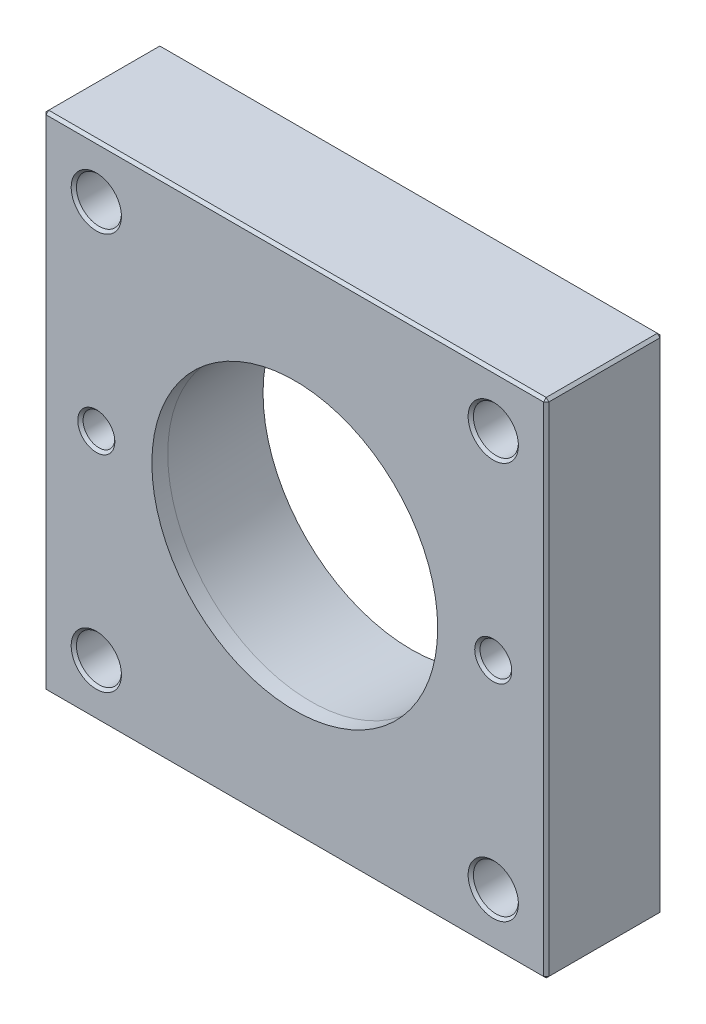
ISO-10303-21;
HEADER;
FILE_DESCRIPTION(('STEP AP214'),'2;1');
FILE_NAME('part.step','',(''),(''),'','','');
FILE_SCHEMA(('AUTOMOTIVE_DESIGN { 1 0 10303 214 1 1 1 1 }'));
ENDSEC;
DATA;
#1=APPLICATION_CONTEXT('core data for automotive mechanical design processes');
#2=APPLICATION_PROTOCOL_DEFINITION('international standard','automotive_design',2000,#1);
#3=PRODUCT_CONTEXT('',#1,'mechanical');
#4=PRODUCT('Part','Part','',(#3));
#5=PRODUCT_RELATED_PRODUCT_CATEGORY('part','',(#4));
#6=PRODUCT_DEFINITION_FORMATION('','',#4);
#7=PRODUCT_DEFINITION_CONTEXT('part definition',#1,'design');
#8=PRODUCT_DEFINITION('design','',#6,#7);
#9=PRODUCT_DEFINITION_SHAPE('','',#8);
#10=(LENGTH_UNIT() NAMED_UNIT(*) SI_UNIT(.MILLI.,.METRE.));
#11=(NAMED_UNIT(*) PLANE_ANGLE_UNIT() SI_UNIT($,.RADIAN.));
#12=(NAMED_UNIT(*) SI_UNIT($,.STERADIAN.) SOLID_ANGLE_UNIT());
#13=UNCERTAINTY_MEASURE_WITH_UNIT(LENGTH_MEASURE(1.E-05),#10,'distance_accuracy_value','');
#14=(GEOMETRIC_REPRESENTATION_CONTEXT(3) GLOBAL_UNCERTAINTY_ASSIGNED_CONTEXT((#13)) GLOBAL_UNIT_ASSIGNED_CONTEXT((#10,
#11,#12)) REPRESENTATION_CONTEXT('',''));
#15=CARTESIAN_POINT('',(0.,0.,0.));
#16=DIRECTION('',(0.,0.,1.));
#17=DIRECTION('',(1.,0.,0.));
#18=AXIS2_PLACEMENT_3D('',#15,#16,#17);
#19=CARTESIAN_POINT('',(-47.5,-47.5,-22.));
#20=DIRECTION('',(0.,0.,-1.));
#21=DIRECTION('',(-1.,0.,0.));
#22=AXIS2_PLACEMENT_3D('',#19,#20,#21);
#23=PLANE('',#22);
#24=DIRECTION('',(0.,1.,0.));
#25=VECTOR('',#24,1.);
#26=CARTESIAN_POINT('',(-47.,47.5,-22.));
#27=LINE('',#26,#25);
#28=CARTESIAN_POINT('',(-47.,-47.,-22.));
#29=VERTEX_POINT('',#28);
#30=CARTESIAN_POINT('',(-47.,47.,-22.));
#31=VERTEX_POINT('',#30);
#32=EDGE_CURVE('E175',#29,#31,#27,.T.);
#33=ORIENTED_EDGE('',*,*,#32,.T.);
#34=DIRECTION('',(1.,0.,0.));
#35=VECTOR('',#34,1.);
#36=CARTESIAN_POINT('',(-47.5,47.,-22.));
#37=LINE('',#36,#35);
#38=CARTESIAN_POINT('',(47.,47.,-22.));
#39=VERTEX_POINT('',#38);
#40=EDGE_CURVE('E140',#31,#39,#37,.T.);
#41=ORIENTED_EDGE('',*,*,#40,.T.);
#42=DIRECTION('',(0.,-1.,0.));
#43=VECTOR('',#42,1.);
#44=CARTESIAN_POINT('',(47.,-47.5,-22.));
#45=LINE('',#44,#43);
#46=CARTESIAN_POINT('',(47.,-47.,-22.));
#47=VERTEX_POINT('',#46);
#48=EDGE_CURVE('E177',#39,#47,#45,.T.);
#49=ORIENTED_EDGE('',*,*,#48,.T.);
#50=DIRECTION('',(-1.,0.,0.));
#51=VECTOR('',#50,1.);
#52=CARTESIAN_POINT('',(-47.5,-47.,-22.));
#53=LINE('',#52,#51);
#54=EDGE_CURVE('E170',#47,#29,#53,.T.);
#55=ORIENTED_EDGE('',*,*,#54,.T.);
#56=EDGE_LOOP('',(#33,#41,#49,#55));
#57=FACE_BOUND('',#56,.T.);
#58=CARTESIAN_POINT('',(37.5,37.5,-22.));
#59=DIRECTION('',(0.,0.,-1.));
#60=DIRECTION('',(-1.,0.,0.));
#61=AXIS2_PLACEMENT_3D('',#58,#59,#60);
#62=CIRCLE('',#61,4.75000000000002);
#63=CARTESIAN_POINT('',(32.75,37.5,-22.));
#64=VERTEX_POINT('',#63);
#65=EDGE_CURVE('E334',#64,#64,#62,.F.);
#66=ORIENTED_EDGE('',*,*,#65,.T.);
#67=EDGE_LOOP('',(#66));
#68=FACE_BOUND('',#67,.T.);
#69=CARTESIAN_POINT('',(-37.5,37.5,-22.));
#70=DIRECTION('',(0.,0.,-1.));
#71=DIRECTION('',(-1.,0.,0.));
#72=AXIS2_PLACEMENT_3D('',#69,#70,#71);
#73=CIRCLE('',#72,4.75000000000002);
#74=CARTESIAN_POINT('',(-42.25,37.5,-22.));
#75=VERTEX_POINT('',#74);
#76=EDGE_CURVE('E331',#75,#75,#73,.F.);
#77=ORIENTED_EDGE('',*,*,#76,.T.);
#78=EDGE_LOOP('',(#77));
#79=FACE_BOUND('',#78,.T.);
#80=CARTESIAN_POINT('',(-37.5,0.,-22.));
#81=DIRECTION('',(0.,0.,-1.));
#82=DIRECTION('',(-1.,0.,0.));
#83=AXIS2_PLACEMENT_3D('',#80,#81,#82);
#84=CIRCLE('',#83,3.50000000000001);
#85=CARTESIAN_POINT('',(-41.,0.,-22.));
#86=VERTEX_POINT('',#85);
#87=EDGE_CURVE('E328',#86,#86,#84,.F.);
#88=ORIENTED_EDGE('',*,*,#87,.T.);
#89=EDGE_LOOP('',(#88));
#90=FACE_BOUND('',#89,.T.);
#91=CARTESIAN_POINT('',(37.5,0.,-22.));
#92=DIRECTION('',(0.,0.,-1.));
#93=DIRECTION('',(-1.,0.,0.));
#94=AXIS2_PLACEMENT_3D('',#91,#92,#93);
#95=CIRCLE('',#94,3.50000000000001);
#96=CARTESIAN_POINT('',(34.,0.,-22.));
#97=VERTEX_POINT('',#96);
#98=EDGE_CURVE('E325',#97,#97,#95,.F.);
#99=ORIENTED_EDGE('',*,*,#98,.T.);
#100=EDGE_LOOP('',(#99));
#101=FACE_BOUND('',#100,.T.);
#102=CARTESIAN_POINT('',(37.5,-37.5,-22.));
#103=DIRECTION('',(0.,0.,-1.));
#104=DIRECTION('',(-1.,0.,0.));
#105=AXIS2_PLACEMENT_3D('',#102,#103,#104);
#106=CIRCLE('',#105,4.75000000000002);
#107=CARTESIAN_POINT('',(32.75,-37.5,-22.));
#108=VERTEX_POINT('',#107);
#109=EDGE_CURVE('E322',#108,#108,#106,.F.);
#110=ORIENTED_EDGE('',*,*,#109,.T.);
#111=EDGE_LOOP('',(#110));
#112=FACE_BOUND('',#111,.T.);
#113=CARTESIAN_POINT('',(-37.5,-37.5,-22.));
#114=DIRECTION('',(0.,0.,-1.));
#115=DIRECTION('',(-1.,0.,0.));
#116=AXIS2_PLACEMENT_3D('',#113,#114,#115);
#117=CIRCLE('',#116,4.75000000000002);
#118=CARTESIAN_POINT('',(-42.25,-37.5,-22.));
#119=VERTEX_POINT('',#118);
#120=EDGE_CURVE('E319',#119,#119,#117,.F.);
#121=ORIENTED_EDGE('',*,*,#120,.T.);
#122=EDGE_LOOP('',(#121));
#123=FACE_BOUND('',#122,.T.);
#124=CARTESIAN_POINT('',(0.,0.,-22.));
#125=DIRECTION('',(0.,0.,-1.));
#126=DIRECTION('',(-1.,0.,0.));
#127=AXIS2_PLACEMENT_3D('',#124,#125,#126);
#128=CIRCLE('',#127,27.9957478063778);
#129=CARTESIAN_POINT('',(-27.9957478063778,0.,-22.));
#130=VERTEX_POINT('',#129);
#131=EDGE_CURVE('E266',#130,#130,#128,.F.);
#132=ORIENTED_EDGE('',*,*,#131,.T.);
#133=EDGE_LOOP('',(#132));
#134=FACE_BOUND('',#133,.T.);
#135=ADVANCED_FACE('F45',(#57,#68,#79,#90,#101,#112,#123,#134),#23,.T.);
#136=CARTESIAN_POINT('',(-47.5,-47.5,0.));
#137=DIRECTION('',(0.,0.,-1.));
#138=DIRECTION('',(-1.,0.,0.));
#139=AXIS2_PLACEMENT_3D('',#136,#137,#138);
#140=PLANE('',#139);
#141=DIRECTION('',(0.,1.,0.));
#142=VECTOR('',#141,1.);
#143=CARTESIAN_POINT('',(47.,-47.5,0.));
#144=LINE('',#143,#142);
#145=CARTESIAN_POINT('',(47.,-47.,0.));
#146=VERTEX_POINT('',#145);
#147=CARTESIAN_POINT('',(47.,47.,0.));
#148=VERTEX_POINT('',#147);
#149=EDGE_CURVE('E184',#146,#148,#144,.T.);
#150=ORIENTED_EDGE('',*,*,#149,.T.);
#151=DIRECTION('',(-1.,0.,0.));
#152=VECTOR('',#151,1.);
#153=CARTESIAN_POINT('',(-47.5,47.,0.));
#154=LINE('',#153,#152);
#155=CARTESIAN_POINT('',(-47.,47.,0.));
#156=VERTEX_POINT('',#155);
#157=EDGE_CURVE('E186',#148,#156,#154,.T.);
#158=ORIENTED_EDGE('',*,*,#157,.T.);
#159=DIRECTION('',(0.,-1.,0.));
#160=VECTOR('',#159,1.);
#161=CARTESIAN_POINT('',(-47.,-47.5,0.));
#162=LINE('',#161,#160);
#163=CARTESIAN_POINT('',(-47.,-47.,0.));
#164=VERTEX_POINT('',#163);
#165=EDGE_CURVE('E182',#156,#164,#162,.T.);
#166=ORIENTED_EDGE('',*,*,#165,.T.);
#167=DIRECTION('',(1.,0.,0.));
#168=VECTOR('',#167,1.);
#169=CARTESIAN_POINT('',(47.5,-47.,0.));
#170=LINE('',#169,#168);
#171=EDGE_CURVE('E180',#164,#146,#170,.T.);
#172=ORIENTED_EDGE('',*,*,#171,.T.);
#173=EDGE_LOOP('',(#150,#158,#166,#172));
#174=FACE_BOUND('',#173,.T.);
#175=CARTESIAN_POINT('',(-37.5,37.5,0.));
#176=DIRECTION('',(0.,0.,-1.));
#177=DIRECTION('',(-1.,0.,0.));
#178=AXIS2_PLACEMENT_3D('',#175,#176,#177);
#179=CIRCLE('',#178,4.75000000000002);
#180=CARTESIAN_POINT('',(-42.25,37.5,0.));
#181=VERTEX_POINT('',#180);
#182=EDGE_CURVE('E298',#181,#181,#179,.T.);
#183=ORIENTED_EDGE('',*,*,#182,.T.);
#184=EDGE_LOOP('',(#183));
#185=FACE_BOUND('',#184,.T.);
#186=CARTESIAN_POINT('',(37.5,37.5,0.));
#187=DIRECTION('',(0.,0.,-1.));
#188=DIRECTION('',(-1.,0.,0.));
#189=AXIS2_PLACEMENT_3D('',#186,#187,#188);
#190=CIRCLE('',#189,4.75000000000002);
#191=CARTESIAN_POINT('',(32.75,37.5,0.));
#192=VERTEX_POINT('',#191);
#193=EDGE_CURVE('E295',#192,#192,#190,.T.);
#194=ORIENTED_EDGE('',*,*,#193,.T.);
#195=EDGE_LOOP('',(#194));
#196=FACE_BOUND('',#195,.T.);
#197=CARTESIAN_POINT('',(37.5,0.,0.));
#198=DIRECTION('',(0.,0.,-1.));
#199=DIRECTION('',(-1.,0.,0.));
#200=AXIS2_PLACEMENT_3D('',#197,#198,#199);
#201=CIRCLE('',#200,3.50000000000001);
#202=CARTESIAN_POINT('',(34.,0.,0.));
#203=VERTEX_POINT('',#202);
#204=EDGE_CURVE('E292',#203,#203,#201,.T.);
#205=ORIENTED_EDGE('',*,*,#204,.T.);
#206=EDGE_LOOP('',(#205));
#207=FACE_BOUND('',#206,.T.);
#208=CARTESIAN_POINT('',(-37.5,0.,0.));
#209=DIRECTION('',(0.,0.,-1.));
#210=DIRECTION('',(-1.,0.,0.));
#211=AXIS2_PLACEMENT_3D('',#208,#209,#210);
#212=CIRCLE('',#211,3.50000000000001);
#213=CARTESIAN_POINT('',(-41.,0.,0.));
#214=VERTEX_POINT('',#213);
#215=EDGE_CURVE('E289',#214,#214,#212,.T.);
#216=ORIENTED_EDGE('',*,*,#215,.T.);
#217=EDGE_LOOP('',(#216));
#218=FACE_BOUND('',#217,.T.);
#219=CARTESIAN_POINT('',(-37.5,-37.5,0.));
#220=DIRECTION('',(0.,0.,-1.));
#221=DIRECTION('',(-1.,0.,0.));
#222=AXIS2_PLACEMENT_3D('',#219,#220,#221);
#223=CIRCLE('',#222,4.75000000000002);
#224=CARTESIAN_POINT('',(-42.25,-37.5,0.));
#225=VERTEX_POINT('',#224);
#226=EDGE_CURVE('E286',#225,#225,#223,.T.);
#227=ORIENTED_EDGE('',*,*,#226,.T.);
#228=EDGE_LOOP('',(#227));
#229=FACE_BOUND('',#228,.T.);
#230=CARTESIAN_POINT('',(37.5,-37.5,0.));
#231=DIRECTION('',(0.,0.,-1.));
#232=DIRECTION('',(-1.,0.,0.));
#233=AXIS2_PLACEMENT_3D('',#230,#231,#232);
#234=CIRCLE('',#233,4.75000000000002);
#235=CARTESIAN_POINT('',(32.75,-37.5,0.));
#236=VERTEX_POINT('',#235);
#237=EDGE_CURVE('E283',#236,#236,#234,.T.);
#238=ORIENTED_EDGE('',*,*,#237,.T.);
#239=EDGE_LOOP('',(#238));
#240=FACE_BOUND('',#239,.T.);
#241=CARTESIAN_POINT('',(0.,0.,0.));
#242=DIRECTION('',(0.,0.,1.));
#243=DIRECTION('',(1.,0.,0.));
#244=AXIS2_PLACEMENT_3D('',#241,#242,#243);
#245=CIRCLE('',#244,27.);
#246=CARTESIAN_POINT('',(27.,0.,0.));
#247=VERTEX_POINT('',#246);
#248=EDGE_CURVE('E278',#247,#247,#245,.T.);
#249=ORIENTED_EDGE('',*,*,#248,.F.);
#250=EDGE_LOOP('',(#249));
#251=FACE_BOUND('',#250,.T.);
#252=ADVANCED_FACE('F366',(#174,#185,#196,#207,#218,#229,#240,#251),#140,.F.);
#253=CARTESIAN_POINT('',(-47.5,-47.5,-22.));
#254=DIRECTION('',(1.,0.,0.));
#255=DIRECTION('',(0.,1.,0.));
#256=AXIS2_PLACEMENT_3D('',#253,#254,#255);
#257=PLANE('',#256);
#258=DIRECTION('',(0.,0.,-1.));
#259=VECTOR('',#258,1.);
#260=CARTESIAN_POINT('',(-47.5,47.,-22.));
#261=LINE('',#260,#259);
#262=CARTESIAN_POINT('',(-47.5,47.,-0.500000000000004));
#263=VERTEX_POINT('',#262);
#264=CARTESIAN_POINT('',(-47.5,47.,-21.5));
#265=VERTEX_POINT('',#264);
#266=EDGE_CURVE('E202',#263,#265,#261,.T.);
#267=ORIENTED_EDGE('',*,*,#266,.T.);
#268=DIRECTION('',(0.,-1.,0.));
#269=VECTOR('',#268,1.);
#270=CARTESIAN_POINT('',(-47.5,-47.5,-21.5));
#271=LINE('',#270,#269);
#272=CARTESIAN_POINT('',(-47.5,-47.,-21.5));
#273=VERTEX_POINT('',#272);
#274=EDGE_CURVE('E204',#265,#273,#271,.T.);
#275=ORIENTED_EDGE('',*,*,#274,.T.);
#276=DIRECTION('',(0.,0.,1.));
#277=VECTOR('',#276,1.);
#278=CARTESIAN_POINT('',(-47.5,-47.,0.));
#279=LINE('',#278,#277);
#280=CARTESIAN_POINT('',(-47.5,-47.,-0.500000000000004));
#281=VERTEX_POINT('',#280);
#282=EDGE_CURVE('E198',#273,#281,#279,.T.);
#283=ORIENTED_EDGE('',*,*,#282,.T.);
#284=DIRECTION('',(0.,1.,0.));
#285=VECTOR('',#284,1.);
#286=CARTESIAN_POINT('',(-47.5,-47.5,-0.500000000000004));
#287=LINE('',#286,#285);
#288=EDGE_CURVE('E200',#281,#263,#287,.T.);
#289=ORIENTED_EDGE('',*,*,#288,.T.);
#290=EDGE_LOOP('',(#267,#275,#283,#289));
#291=FACE_BOUND('',#290,.T.);
#292=ADVANCED_FACE('F372',(#291),#257,.F.);
#293=CARTESIAN_POINT('',(47.5,47.5,-22.));
#294=DIRECTION('',(0.,1.,0.));
#295=DIRECTION('',(-1.,0.,0.));
#296=AXIS2_PLACEMENT_3D('',#293,#294,#295);
#297=PLANE('',#296);
#298=DIRECTION('',(1.,0.,0.));
#299=VECTOR('',#298,1.);
#300=CARTESIAN_POINT('',(47.5,47.5,-0.500000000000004));
#301=LINE('',#300,#299);
#302=CARTESIAN_POINT('',(-47.,47.5,-0.500000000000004));
#303=VERTEX_POINT('',#302);
#304=CARTESIAN_POINT('',(47.,47.5,-0.500000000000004));
#305=VERTEX_POINT('',#304);
#306=EDGE_CURVE('E162',#303,#305,#301,.T.);
#307=ORIENTED_EDGE('',*,*,#306,.T.);
#308=DIRECTION('',(0.,0.,-1.));
#309=VECTOR('',#308,1.);
#310=CARTESIAN_POINT('',(47.,47.5,-22.));
#311=LINE('',#310,#309);
#312=CARTESIAN_POINT('',(47.,47.5,-21.5));
#313=VERTEX_POINT('',#312);
#314=EDGE_CURVE('E167',#305,#313,#311,.T.);
#315=ORIENTED_EDGE('',*,*,#314,.T.);
#316=DIRECTION('',(-1.,0.,0.));
#317=VECTOR('',#316,1.);
#318=CARTESIAN_POINT('',(47.5,47.5,-21.5));
#319=LINE('',#318,#317);
#320=CARTESIAN_POINT('',(-47.,47.5,-21.5));
#321=VERTEX_POINT('',#320);
#322=EDGE_CURVE('E138',#313,#321,#319,.T.);
#323=ORIENTED_EDGE('',*,*,#322,.T.);
#324=DIRECTION('',(0.,0.,1.));
#325=VECTOR('',#324,1.);
#326=CARTESIAN_POINT('',(-47.,47.5,0.));
#327=LINE('',#326,#325);
#328=EDGE_CURVE('E156',#321,#303,#327,.T.);
#329=ORIENTED_EDGE('',*,*,#328,.T.);
#330=EDGE_LOOP('',(#307,#315,#323,#329));
#331=FACE_BOUND('',#330,.T.);
#332=ADVANCED_FACE('F165',(#331),#297,.T.);
#333=CARTESIAN_POINT('',(47.5,47.5,-22.));
#334=DIRECTION('',(-1.,0.,0.));
#335=DIRECTION('',(0.,-1.,0.));
#336=AXIS2_PLACEMENT_3D('',#333,#334,#335);
#337=PLANE('',#336);
#338=DIRECTION('',(0.,1.,0.));
#339=VECTOR('',#338,1.);
#340=CARTESIAN_POINT('',(47.5,47.5,-21.5));
#341=LINE('',#340,#339);
#342=CARTESIAN_POINT('',(47.5,-47.,-21.5));
#343=VERTEX_POINT('',#342);
#344=CARTESIAN_POINT('',(47.5,47.,-21.5));
#345=VERTEX_POINT('',#344);
#346=EDGE_CURVE('E193',#343,#345,#341,.T.);
#347=ORIENTED_EDGE('',*,*,#346,.T.);
#348=DIRECTION('',(0.,0.,1.));
#349=VECTOR('',#348,1.);
#350=CARTESIAN_POINT('',(47.5,47.,0.));
#351=LINE('',#350,#349);
#352=CARTESIAN_POINT('',(47.5,47.,-0.500000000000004));
#353=VERTEX_POINT('',#352);
#354=EDGE_CURVE('E195',#345,#353,#351,.T.);
#355=ORIENTED_EDGE('',*,*,#354,.T.);
#356=DIRECTION('',(0.,-1.,0.));
#357=VECTOR('',#356,1.);
#358=CARTESIAN_POINT('',(47.5,47.5,-0.500000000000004));
#359=LINE('',#358,#357);
#360=CARTESIAN_POINT('',(47.5,-47.,-0.500000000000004));
#361=VERTEX_POINT('',#360);
#362=EDGE_CURVE('E191',#353,#361,#359,.T.);
#363=ORIENTED_EDGE('',*,*,#362,.T.);
#364=DIRECTION('',(0.,0.,-1.));
#365=VECTOR('',#364,1.);
#366=CARTESIAN_POINT('',(47.5,-47.,-22.));
#367=LINE('',#366,#365);
#368=EDGE_CURVE('E189',#361,#343,#367,.T.);
#369=ORIENTED_EDGE('',*,*,#368,.T.);
#370=EDGE_LOOP('',(#347,#355,#363,#369));
#371=FACE_BOUND('',#370,.T.);
#372=ADVANCED_FACE('F383',(#371),#337,.F.);
#373=CARTESIAN_POINT('',(-47.5,-47.5,-22.));
#374=DIRECTION('',(0.,-1.,0.));
#375=DIRECTION('',(0.,0.,-1.));
#376=AXIS2_PLACEMENT_3D('',#373,#374,#375);
#377=PLANE('',#376);
#378=DIRECTION('',(1.,0.,0.));
#379=VECTOR('',#378,1.);
#380=CARTESIAN_POINT('',(-47.5,-47.5,-21.5));
#381=LINE('',#380,#379);
#382=CARTESIAN_POINT('',(-47.,-47.5,-21.5));
#383=VERTEX_POINT('',#382);
#384=CARTESIAN_POINT('',(47.,-47.5,-21.5));
#385=VERTEX_POINT('',#384);
#386=EDGE_CURVE('E54',#383,#385,#381,.T.);
#387=ORIENTED_EDGE('',*,*,#386,.T.);
#388=DIRECTION('',(0.,0.,1.));
#389=VECTOR('',#388,1.);
#390=CARTESIAN_POINT('',(47.,-47.5,0.));
#391=LINE('',#390,#389);
#392=CARTESIAN_POINT('',(47.,-47.5,-0.500000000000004));
#393=VERTEX_POINT('',#392);
#394=EDGE_CURVE('E11',#385,#393,#391,.T.);
#395=ORIENTED_EDGE('',*,*,#394,.T.);
#396=DIRECTION('',(-1.,0.,0.));
#397=VECTOR('',#396,1.);
#398=CARTESIAN_POINT('',(-47.5,-47.5,-0.500000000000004));
#399=LINE('',#398,#397);
#400=CARTESIAN_POINT('',(-47.,-47.5,-0.500000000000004));
#401=VERTEX_POINT('',#400);
#402=EDGE_CURVE('E207',#393,#401,#399,.T.);
#403=ORIENTED_EDGE('',*,*,#402,.T.);
#404=DIRECTION('',(0.,0.,-1.));
#405=VECTOR('',#404,1.);
#406=CARTESIAN_POINT('',(-47.,-47.5,-22.));
#407=LINE('',#406,#405);
#408=EDGE_CURVE('E65',#401,#383,#407,.T.);
#409=ORIENTED_EDGE('',*,*,#408,.T.);
#410=EDGE_LOOP('',(#387,#395,#403,#409));
#411=FACE_BOUND('',#410,.T.);
#412=ADVANCED_FACE('F380',(#411),#377,.T.);
#413=CARTESIAN_POINT('',(0.,0.,-22.));
#414=DIRECTION('',(0.,0.,1.));
#415=DIRECTION('',(1.,0.,0.));
#416=AXIS2_PLACEMENT_3D('',#413,#414,#415);
#417=CYLINDRICAL_SURFACE('',#416,27.);
#418=CARTESIAN_POINT('',(0.,0.,-3.));
#419=DIRECTION('',(0.,0.,1.));
#420=DIRECTION('',(1.,0.,0.));
#421=AXIS2_PLACEMENT_3D('',#418,#419,#420);
#422=CIRCLE('',#421,27.);
#423=CARTESIAN_POINT('',(27.,0.,-3.));
#424=VERTEX_POINT('',#423);
#425=EDGE_CURVE('E273',#424,#424,#422,.T.);
#426=ORIENTED_EDGE('',*,*,#425,.F.);
#427=EDGE_LOOP('',(#426));
#428=FACE_BOUND('',#427,.T.);
#429=ORIENTED_EDGE('',*,*,#248,.T.);
#430=EDGE_LOOP('',(#429));
#431=FACE_BOUND('',#430,.T.);
#432=ADVANCED_FACE('F377',(#428,#431),#417,.F.);
#433=CARTESIAN_POINT('',(-37.5,-37.5,-22.));
#434=DIRECTION('',(0.,0.,1.));
#435=DIRECTION('',(1.,0.,0.));
#436=AXIS2_PLACEMENT_3D('',#433,#434,#435);
#437=CYLINDRICAL_SURFACE('',#436,4.25000000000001);
#438=CARTESIAN_POINT('',(-37.5,-37.5,-21.5));
#439=DIRECTION('',(0.,0.,-1.));
#440=DIRECTION('',(-1.,0.,0.));
#441=AXIS2_PLACEMENT_3D('',#438,#439,#440);
#442=CIRCLE('',#441,4.25000000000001);
#443=CARTESIAN_POINT('',(-41.75,-37.5,-21.5));
#444=VERTEX_POINT('',#443);
#445=EDGE_CURVE('E163',#444,#444,#442,.T.);
#446=ORIENTED_EDGE('',*,*,#445,.T.);
#447=EDGE_LOOP('',(#446));
#448=FACE_BOUND('',#447,.T.);
#449=CARTESIAN_POINT('',(-37.5,-37.5,-0.500000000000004));
#450=DIRECTION('',(0.,0.,-1.));
#451=DIRECTION('',(-1.,0.,0.));
#452=AXIS2_PLACEMENT_3D('',#449,#450,#451);
#453=CIRCLE('',#452,4.25000000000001);
#454=CARTESIAN_POINT('',(-41.75,-37.5,-0.500000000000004));
#455=VERTEX_POINT('',#454);
#456=EDGE_CURVE('E313',#455,#455,#453,.F.);
#457=ORIENTED_EDGE('',*,*,#456,.T.);
#458=EDGE_LOOP('',(#457));
#459=FACE_BOUND('',#458,.T.);
#460=ADVANCED_FACE('F355',(#448,#459),#437,.F.);
#461=CARTESIAN_POINT('',(-37.5,37.5,-22.));
#462=DIRECTION('',(0.,0.,1.));
#463=DIRECTION('',(1.,0.,0.));
#464=AXIS2_PLACEMENT_3D('',#461,#462,#463);
#465=CYLINDRICAL_SURFACE('',#464,4.25000000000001);
#466=CARTESIAN_POINT('',(-37.5,37.5,-21.5));
#467=DIRECTION('',(0.,0.,-1.));
#468=DIRECTION('',(-1.,0.,0.));
#469=AXIS2_PLACEMENT_3D('',#466,#467,#468);
#470=CIRCLE('',#469,4.25000000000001);
#471=CARTESIAN_POINT('',(-41.75,37.5,-21.5));
#472=VERTEX_POINT('',#471);
#473=EDGE_CURVE('E340',#472,#472,#470,.T.);
#474=ORIENTED_EDGE('',*,*,#473,.T.);
#475=EDGE_LOOP('',(#474));
#476=FACE_BOUND('',#475,.T.);
#477=CARTESIAN_POINT('',(-37.5,37.5,-0.500000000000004));
#478=DIRECTION('',(0.,0.,-1.));
#479=DIRECTION('',(-1.,0.,0.));
#480=AXIS2_PLACEMENT_3D('',#477,#478,#479);
#481=CIRCLE('',#480,4.25000000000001);
#482=CARTESIAN_POINT('',(-41.75,37.5,-0.500000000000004));
#483=VERTEX_POINT('',#482);
#484=EDGE_CURVE('E301',#483,#483,#481,.F.);
#485=ORIENTED_EDGE('',*,*,#484,.T.);
#486=EDGE_LOOP('',(#485));
#487=FACE_BOUND('',#486,.T.);
#488=ADVANCED_FACE('F553',(#476,#487),#465,.F.);
#489=CARTESIAN_POINT('',(37.5,-37.5,-22.));
#490=DIRECTION('',(0.,0.,1.));
#491=DIRECTION('',(1.,0.,0.));
#492=AXIS2_PLACEMENT_3D('',#489,#490,#491);
#493=CYLINDRICAL_SURFACE('',#492,4.25000000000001);
#494=CARTESIAN_POINT('',(37.5,-37.5,-21.5));
#495=DIRECTION('',(0.,0.,-1.));
#496=DIRECTION('',(-1.,0.,0.));
#497=AXIS2_PLACEMENT_3D('',#494,#495,#496);
#498=CIRCLE('',#497,4.25000000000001);
#499=CARTESIAN_POINT('',(33.25,-37.5,-21.5));
#500=VERTEX_POINT('',#499);
#501=EDGE_CURVE('E349',#500,#500,#498,.T.);
#502=ORIENTED_EDGE('',*,*,#501,.T.);
#503=EDGE_LOOP('',(#502));
#504=FACE_BOUND('',#503,.T.);
#505=CARTESIAN_POINT('',(37.5,-37.5,-0.500000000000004));
#506=DIRECTION('',(0.,0.,-1.));
#507=DIRECTION('',(-1.,0.,0.));
#508=AXIS2_PLACEMENT_3D('',#505,#506,#507);
#509=CIRCLE('',#508,4.25000000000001);
#510=CARTESIAN_POINT('',(33.25,-37.5,-0.500000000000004));
#511=VERTEX_POINT('',#510);
#512=EDGE_CURVE('E316',#511,#511,#509,.F.);
#513=ORIENTED_EDGE('',*,*,#512,.T.);
#514=EDGE_LOOP('',(#513));
#515=FACE_BOUND('',#514,.T.);
#516=ADVANCED_FACE('F573',(#504,#515),#493,.F.);
#517=CARTESIAN_POINT('',(37.5,37.5,-22.));
#518=DIRECTION('',(0.,0.,1.));
#519=DIRECTION('',(1.,0.,0.));
#520=AXIS2_PLACEMENT_3D('',#517,#518,#519);
#521=CYLINDRICAL_SURFACE('',#520,4.25000000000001);
#522=CARTESIAN_POINT('',(37.5,37.5,-21.5));
#523=DIRECTION('',(0.,0.,-1.));
#524=DIRECTION('',(-1.,0.,0.));
#525=AXIS2_PLACEMENT_3D('',#522,#523,#524);
#526=CIRCLE('',#525,4.25000000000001);
#527=CARTESIAN_POINT('',(33.25,37.5,-21.5));
#528=VERTEX_POINT('',#527);
#529=EDGE_CURVE('E337',#528,#528,#526,.T.);
#530=ORIENTED_EDGE('',*,*,#529,.T.);
#531=EDGE_LOOP('',(#530));
#532=FACE_BOUND('',#531,.T.);
#533=CARTESIAN_POINT('',(37.5,37.5,-0.500000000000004));
#534=DIRECTION('',(0.,0.,-1.));
#535=DIRECTION('',(-1.,0.,0.));
#536=AXIS2_PLACEMENT_3D('',#533,#534,#535);
#537=CIRCLE('',#536,4.25000000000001);
#538=CARTESIAN_POINT('',(33.25,37.5,-0.500000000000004));
#539=VERTEX_POINT('',#538);
#540=EDGE_CURVE('E304',#539,#539,#537,.F.);
#541=ORIENTED_EDGE('',*,*,#540,.T.);
#542=EDGE_LOOP('',(#541));
#543=FACE_BOUND('',#542,.T.);
#544=ADVANCED_FACE('F569',(#532,#543),#521,.F.);
#545=CARTESIAN_POINT('',(-37.5,0.,-22.));
#546=DIRECTION('',(0.,0.,1.));
#547=DIRECTION('',(1.,0.,0.));
#548=AXIS2_PLACEMENT_3D('',#545,#546,#547);
#549=CYLINDRICAL_SURFACE('',#548,3.);
#550=CARTESIAN_POINT('',(-37.5,0.,-21.5));
#551=DIRECTION('',(0.,0.,-1.));
#552=DIRECTION('',(-1.,0.,0.));
#553=AXIS2_PLACEMENT_3D('',#550,#551,#552);
#554=CIRCLE('',#553,3.);
#555=CARTESIAN_POINT('',(-40.5,0.,-21.5));
#556=VERTEX_POINT('',#555);
#557=EDGE_CURVE('E343',#556,#556,#554,.T.);
#558=ORIENTED_EDGE('',*,*,#557,.T.);
#559=EDGE_LOOP('',(#558));
#560=FACE_BOUND('',#559,.T.);
#561=CARTESIAN_POINT('',(-37.5,0.,-0.500000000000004));
#562=DIRECTION('',(0.,0.,-1.));
#563=DIRECTION('',(-1.,0.,0.));
#564=AXIS2_PLACEMENT_3D('',#561,#562,#563);
#565=CIRCLE('',#564,3.);
#566=CARTESIAN_POINT('',(-40.5,0.,-0.500000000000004));
#567=VERTEX_POINT('',#566);
#568=EDGE_CURVE('E310',#567,#567,#565,.F.);
#569=ORIENTED_EDGE('',*,*,#568,.T.);
#570=EDGE_LOOP('',(#569));
#571=FACE_BOUND('',#570,.T.);
#572=ADVANCED_FACE('F563',(#560,#571),#549,.F.);
#573=CARTESIAN_POINT('',(37.5,0.,-22.));
#574=DIRECTION('',(0.,0.,1.));
#575=DIRECTION('',(1.,0.,0.));
#576=AXIS2_PLACEMENT_3D('',#573,#574,#575);
#577=CYLINDRICAL_SURFACE('',#576,3.);
#578=CARTESIAN_POINT('',(37.5,0.,-21.5));
#579=DIRECTION('',(0.,0.,-1.));
#580=DIRECTION('',(-1.,0.,0.));
#581=AXIS2_PLACEMENT_3D('',#578,#579,#580);
#582=CIRCLE('',#581,3.);
#583=CARTESIAN_POINT('',(34.5,0.,-21.5));
#584=VERTEX_POINT('',#583);
#585=EDGE_CURVE('E346',#584,#584,#582,.T.);
#586=ORIENTED_EDGE('',*,*,#585,.T.);
#587=EDGE_LOOP('',(#586));
#588=FACE_BOUND('',#587,.T.);
#589=CARTESIAN_POINT('',(37.5,0.,-0.500000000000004));
#590=DIRECTION('',(0.,0.,-1.));
#591=DIRECTION('',(-1.,0.,0.));
#592=AXIS2_PLACEMENT_3D('',#589,#590,#591);
#593=CIRCLE('',#592,3.);
#594=CARTESIAN_POINT('',(34.5,0.,-0.500000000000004));
#595=VERTEX_POINT('',#594);
#596=EDGE_CURVE('E307',#595,#595,#593,.F.);
#597=ORIENTED_EDGE('',*,*,#596,.T.);
#598=EDGE_LOOP('',(#597));
#599=FACE_BOUND('',#598,.T.);
#600=ADVANCED_FACE('F557',(#588,#599),#577,.F.);
#601=CARTESIAN_POINT('',(0.,0.,-3.));
#602=DIRECTION('',(0.,0.,-1.));
#603=DIRECTION('',(1.,0.,0.));
#604=AXIS2_PLACEMENT_3D('',#601,#602,#603);
#605=CONICAL_SURFACE('',#604,27.,0.05235987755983);
#606=ORIENTED_EDGE('',*,*,#131,.F.);
#607=EDGE_LOOP('',(#606));
#608=FACE_BOUND('',#607,.T.);
#609=ORIENTED_EDGE('',*,*,#425,.T.);
#610=EDGE_LOOP('',(#609));
#611=FACE_BOUND('',#610,.T.);
#612=ADVANCED_FACE('F396',(#608,#611),#605,.F.);
#613=CARTESIAN_POINT('',(-37.5,37.5,0.));
#614=DIRECTION('',(0.,0.,1.));
#615=DIRECTION('',(1.,0.,0.));
#616=AXIS2_PLACEMENT_3D('',#613,#614,#615);
#617=CONICAL_SURFACE('',#616,4.75000000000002,0.785398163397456);
#618=ORIENTED_EDGE('',*,*,#484,.F.);
#619=EDGE_LOOP('',(#618));
#620=FACE_BOUND('',#619,.T.);
#621=ORIENTED_EDGE('',*,*,#182,.F.);
#622=EDGE_LOOP('',(#621));
#623=FACE_BOUND('',#622,.T.);
#624=ADVANCED_FACE('F392',(#620,#623),#617,.F.);
#625=CARTESIAN_POINT('',(37.5,37.5,-0.500000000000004));
#626=DIRECTION('',(0.,0.,1.));
#627=DIRECTION('',(1.,0.,0.));
#628=AXIS2_PLACEMENT_3D('',#625,#626,#627);
#629=CONICAL_SURFACE('',#628,4.25000000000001,0.785398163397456);
#630=ORIENTED_EDGE('',*,*,#193,.F.);
#631=EDGE_LOOP('',(#630));
#632=FACE_BOUND('',#631,.T.);
#633=ORIENTED_EDGE('',*,*,#540,.F.);
#634=EDGE_LOOP('',(#633));
#635=FACE_BOUND('',#634,.T.);
#636=ADVANCED_FACE('F395',(#632,#635),#629,.F.);
#637=CARTESIAN_POINT('',(37.5,0.,0.));
#638=DIRECTION('',(0.,0.,1.));
#639=DIRECTION('',(1.,0.,0.));
#640=AXIS2_PLACEMENT_3D('',#637,#638,#639);
#641=CONICAL_SURFACE('',#640,3.50000000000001,0.785398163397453);
#642=ORIENTED_EDGE('',*,*,#596,.F.);
#643=EDGE_LOOP('',(#642));
#644=FACE_BOUND('',#643,.T.);
#645=ORIENTED_EDGE('',*,*,#204,.F.);
#646=EDGE_LOOP('',(#645));
#647=FACE_BOUND('',#646,.T.);
#648=ADVANCED_FACE('F400',(#644,#647),#641,.F.);
#649=CARTESIAN_POINT('',(-37.5,0.,-0.500000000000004));
#650=DIRECTION('',(0.,0.,1.));
#651=DIRECTION('',(1.,0.,0.));
#652=AXIS2_PLACEMENT_3D('',#649,#650,#651);
#653=CONICAL_SURFACE('',#652,3.,0.785398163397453);
#654=ORIENTED_EDGE('',*,*,#215,.F.);
#655=EDGE_LOOP('',(#654));
#656=FACE_BOUND('',#655,.T.);
#657=ORIENTED_EDGE('',*,*,#568,.F.);
#658=EDGE_LOOP('',(#657));
#659=FACE_BOUND('',#658,.T.);
#660=ADVANCED_FACE('F404',(#656,#659),#653,.F.);
#661=CARTESIAN_POINT('',(-37.5,-37.5,-0.500000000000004));
#662=DIRECTION('',(0.,0.,1.));
#663=DIRECTION('',(1.,0.,0.));
#664=AXIS2_PLACEMENT_3D('',#661,#662,#663);
#665=CONICAL_SURFACE('',#664,4.25000000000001,0.785398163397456);
#666=ORIENTED_EDGE('',*,*,#226,.F.);
#667=EDGE_LOOP('',(#666));
#668=FACE_BOUND('',#667,.T.);
#669=ORIENTED_EDGE('',*,*,#456,.F.);
#670=EDGE_LOOP('',(#669));
#671=FACE_BOUND('',#670,.T.);
#672=ADVANCED_FACE('F408',(#668,#671),#665,.F.);
#673=CARTESIAN_POINT('',(37.5,-37.5,0.));
#674=DIRECTION('',(0.,0.,1.));
#675=DIRECTION('',(1.,0.,0.));
#676=AXIS2_PLACEMENT_3D('',#673,#674,#675);
#677=CONICAL_SURFACE('',#676,4.75000000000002,0.785398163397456);
#678=ORIENTED_EDGE('',*,*,#512,.F.);
#679=EDGE_LOOP('',(#678));
#680=FACE_BOUND('',#679,.T.);
#681=ORIENTED_EDGE('',*,*,#237,.F.);
#682=EDGE_LOOP('',(#681));
#683=FACE_BOUND('',#682,.T.);
#684=ADVANCED_FACE('F412',(#680,#683),#677,.F.);
#685=CARTESIAN_POINT('',(37.5,37.5,-22.));
#686=DIRECTION('',(0.,0.,-1.));
#687=DIRECTION('',(-1.,0.,0.));
#688=AXIS2_PLACEMENT_3D('',#685,#686,#687);
#689=CONICAL_SURFACE('',#688,4.75000000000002,0.785398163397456);
#690=ORIENTED_EDGE('',*,*,#529,.F.);
#691=EDGE_LOOP('',(#690));
#692=FACE_BOUND('',#691,.T.);
#693=ORIENTED_EDGE('',*,*,#65,.F.);
#694=EDGE_LOOP('',(#693));
#695=FACE_BOUND('',#694,.T.);
#696=ADVANCED_FACE('F416',(#692,#695),#689,.F.);
#697=CARTESIAN_POINT('',(-37.5,37.5,-21.5));
#698=DIRECTION('',(0.,0.,-1.));
#699=DIRECTION('',(-1.,0.,0.));
#700=AXIS2_PLACEMENT_3D('',#697,#698,#699);
#701=CONICAL_SURFACE('',#700,4.25000000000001,0.785398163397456);
#702=ORIENTED_EDGE('',*,*,#76,.F.);
#703=EDGE_LOOP('',(#702));
#704=FACE_BOUND('',#703,.T.);
#705=ORIENTED_EDGE('',*,*,#473,.F.);
#706=EDGE_LOOP('',(#705));
#707=FACE_BOUND('',#706,.T.);
#708=ADVANCED_FACE('F420',(#704,#707),#701,.F.);
#709=CARTESIAN_POINT('',(-37.5,0.,-22.));
#710=DIRECTION('',(0.,0.,-1.));
#711=DIRECTION('',(-1.,0.,0.));
#712=AXIS2_PLACEMENT_3D('',#709,#710,#711);
#713=CONICAL_SURFACE('',#712,3.50000000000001,0.785398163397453);
#714=ORIENTED_EDGE('',*,*,#557,.F.);
#715=EDGE_LOOP('',(#714));
#716=FACE_BOUND('',#715,.T.);
#717=ORIENTED_EDGE('',*,*,#87,.F.);
#718=EDGE_LOOP('',(#717));
#719=FACE_BOUND('',#718,.T.);
#720=ADVANCED_FACE('F424',(#716,#719),#713,.F.);
#721=CARTESIAN_POINT('',(37.5,0.,-21.5));
#722=DIRECTION('',(0.,0.,-1.));
#723=DIRECTION('',(-1.,0.,0.));
#724=AXIS2_PLACEMENT_3D('',#721,#722,#723);
#725=CONICAL_SURFACE('',#724,3.,0.785398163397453);
#726=ORIENTED_EDGE('',*,*,#98,.F.);
#727=EDGE_LOOP('',(#726));
#728=FACE_BOUND('',#727,.T.);
#729=ORIENTED_EDGE('',*,*,#585,.F.);
#730=EDGE_LOOP('',(#729));
#731=FACE_BOUND('',#730,.T.);
#732=ADVANCED_FACE('F428',(#728,#731),#725,.F.);
#733=CARTESIAN_POINT('',(37.5,-37.5,-21.5));
#734=DIRECTION('',(0.,0.,-1.));
#735=DIRECTION('',(-1.,0.,0.));
#736=AXIS2_PLACEMENT_3D('',#733,#734,#735);
#737=CONICAL_SURFACE('',#736,4.25000000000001,0.785398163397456);
#738=ORIENTED_EDGE('',*,*,#109,.F.);
#739=EDGE_LOOP('',(#738));
#740=FACE_BOUND('',#739,.T.);
#741=ORIENTED_EDGE('',*,*,#501,.F.);
#742=EDGE_LOOP('',(#741));
#743=FACE_BOUND('',#742,.T.);
#744=ADVANCED_FACE('F361',(#740,#743),#737,.F.);
#745=CARTESIAN_POINT('',(-37.5,-37.5,-22.));
#746=DIRECTION('',(0.,0.,-1.));
#747=DIRECTION('',(-1.,0.,0.));
#748=AXIS2_PLACEMENT_3D('',#745,#746,#747);
#749=CONICAL_SURFACE('',#748,4.75000000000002,0.785398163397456);
#750=ORIENTED_EDGE('',*,*,#445,.F.);
#751=EDGE_LOOP('',(#750));
#752=FACE_BOUND('',#751,.T.);
#753=ORIENTED_EDGE('',*,*,#120,.F.);
#754=EDGE_LOOP('',(#753));
#755=FACE_BOUND('',#754,.T.);
#756=ADVANCED_FACE('F358',(#752,#755),#749,.F.);
#757=CARTESIAN_POINT('',(-47.5,-47.,0.));
#758=DIRECTION('',(0.,-0.707106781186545,0.70710678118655));
#759=DIRECTION('',(0.,-0.70710678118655,-0.707106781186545));
#760=AXIS2_PLACEMENT_3D('',#757,#758,#759);
#761=PLANE('',#760);
#762=DIRECTION('',(0.,-0.70710678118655,-0.707106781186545));
#763=VECTOR('',#762,1.);
#764=CARTESIAN_POINT('',(47.,-47.25,-0.250000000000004));
#765=LINE('',#764,#763);
#766=EDGE_CURVE('E49',#146,#393,#765,.T.);
#767=ORIENTED_EDGE('',*,*,#766,.F.);
#768=ORIENTED_EDGE('',*,*,#171,.F.);
#769=DIRECTION('',(0.,0.70710678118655,0.707106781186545));
#770=VECTOR('',#769,1.);
#771=CARTESIAN_POINT('',(-47.,-47.,0.));
#772=LINE('',#771,#770);
#773=EDGE_CURVE('E259',#401,#164,#772,.T.);
#774=ORIENTED_EDGE('',*,*,#773,.F.);
#775=ORIENTED_EDGE('',*,*,#402,.F.);
#776=EDGE_LOOP('',(#767,#768,#774,#775));
#777=FACE_BOUND('',#776,.T.);
#778=ADVANCED_FACE('F47',(#777),#761,.T.);
#779=CARTESIAN_POINT('',(47.5,-47.,-0.500000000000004));
#780=DIRECTION('',(0.577350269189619,-0.577350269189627,0.577350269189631));
#781=DIRECTION('',(0.,-0.70710678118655,-0.707106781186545));
#782=AXIS2_PLACEMENT_3D('',#779,#780,#781);
#783=PLANE('',#782);
#784=DIRECTION('',(0.70710678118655,0.,-0.707106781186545));
#785=VECTOR('',#784,1.);
#786=CARTESIAN_POINT('',(47.5,-47.,-0.500000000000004));
#787=LINE('',#786,#785);
#788=EDGE_CURVE('E255',#146,#361,#787,.T.);
#789=ORIENTED_EDGE('',*,*,#788,.F.);
#790=ORIENTED_EDGE('',*,*,#766,.T.);
#791=DIRECTION('',(0.707106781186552,0.707106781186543,0.));
#792=VECTOR('',#791,1.);
#793=CARTESIAN_POINT('',(47.5,-47.,-0.500000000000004));
#794=LINE('',#793,#792);
#795=EDGE_CURVE('E258',#361,#393,#794,.F.);
#796=ORIENTED_EDGE('',*,*,#795,.F.);
#797=EDGE_LOOP('',(#789,#790,#796));
#798=FACE_BOUND('',#797,.T.);
#799=ADVANCED_FACE('F500',(#798),#783,.T.);
#800=CARTESIAN_POINT('',(-47.,-47.,0.));
#801=DIRECTION('',(-0.57735026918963,-0.577350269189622,0.577350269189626));
#802=DIRECTION('',(0.707106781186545,0.,0.70710678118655));
#803=AXIS2_PLACEMENT_3D('',#800,#801,#802);
#804=PLANE('',#803);
#805=DIRECTION('',(0.707106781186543,-0.707106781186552,0.));
#806=VECTOR('',#805,1.);
#807=CARTESIAN_POINT('',(-47.25,-47.25,-0.500000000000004));
#808=LINE('',#807,#806);
#809=EDGE_CURVE('E249',#401,#281,#808,.F.);
#810=ORIENTED_EDGE('',*,*,#809,.F.);
#811=ORIENTED_EDGE('',*,*,#773,.T.);
#812=DIRECTION('',(0.707106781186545,0.,0.70710678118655));
#813=VECTOR('',#812,1.);
#814=CARTESIAN_POINT('',(-47.,-47.,0.));
#815=LINE('',#814,#813);
#816=EDGE_CURVE('E252',#281,#164,#815,.T.);
#817=ORIENTED_EDGE('',*,*,#816,.F.);
#818=EDGE_LOOP('',(#810,#811,#817));
#819=FACE_BOUND('',#818,.T.);
#820=ADVANCED_FACE('F497',(#819),#804,.T.);
#821=CARTESIAN_POINT('',(47.,-47.5,-22.));
#822=DIRECTION('',(0.707106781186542,-0.707106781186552,0.));
#823=DIRECTION('',(0.707106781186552,0.707106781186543,0.));
#824=AXIS2_PLACEMENT_3D('',#821,#822,#823);
#825=PLANE('',#824);
#826=ORIENTED_EDGE('',*,*,#795,.T.);
#827=ORIENTED_EDGE('',*,*,#394,.F.);
#828=DIRECTION('',(-0.707106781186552,-0.707106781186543,0.));
#829=VECTOR('',#828,1.);
#830=CARTESIAN_POINT('',(47.25,-47.25,-21.5));
#831=LINE('',#830,#829);
#832=EDGE_CURVE('E243',#343,#385,#831,.T.);
#833=ORIENTED_EDGE('',*,*,#832,.F.);
#834=ORIENTED_EDGE('',*,*,#368,.F.);
#835=EDGE_LOOP('',(#826,#827,#833,#834));
#836=FACE_BOUND('',#835,.T.);
#837=ADVANCED_FACE('F493',(#836),#825,.T.);
#838=CARTESIAN_POINT('',(47.5,47.5,-0.500000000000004));
#839=DIRECTION('',(-0.707106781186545,0.,-0.70710678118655));
#840=DIRECTION('',(-0.70710678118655,0.,0.707106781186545));
#841=AXIS2_PLACEMENT_3D('',#838,#839,#840);
#842=PLANE('',#841);
#843=ORIENTED_EDGE('',*,*,#788,.T.);
#844=ORIENTED_EDGE('',*,*,#362,.F.);
#845=DIRECTION('',(-0.70710678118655,0.,0.707106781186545));
#846=VECTOR('',#845,1.);
#847=CARTESIAN_POINT('',(47.25,47.,-0.250000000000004));
#848=LINE('',#847,#846);
#849=EDGE_CURVE('E240',#148,#353,#848,.F.);
#850=ORIENTED_EDGE('',*,*,#849,.F.);
#851=ORIENTED_EDGE('',*,*,#149,.F.);
#852=EDGE_LOOP('',(#843,#844,#850,#851));
#853=FACE_BOUND('',#852,.T.);
#854=ADVANCED_FACE('F489',(#853),#842,.F.);
#855=CARTESIAN_POINT('',(-47.5,47.,0.));
#856=DIRECTION('',(0.,0.707106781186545,0.70710678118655));
#857=DIRECTION('',(0.,-0.70710678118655,0.707106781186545));
#858=AXIS2_PLACEMENT_3D('',#855,#856,#857);
#859=PLANE('',#858);
#860=DIRECTION('',(0.,0.70710678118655,-0.707106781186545));
#861=VECTOR('',#860,1.);
#862=CARTESIAN_POINT('',(-47.,47.,0.));
#863=LINE('',#862,#861);
#864=EDGE_CURVE('E234',#156,#303,#863,.T.);
#865=ORIENTED_EDGE('',*,*,#864,.F.);
#866=ORIENTED_EDGE('',*,*,#157,.F.);
#867=DIRECTION('',(0.,-0.70710678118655,0.707106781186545));
#868=VECTOR('',#867,1.);
#869=CARTESIAN_POINT('',(47.,47.5,-0.500000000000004));
#870=LINE('',#869,#868);
#871=EDGE_CURVE('E237',#305,#148,#870,.T.);
#872=ORIENTED_EDGE('',*,*,#871,.F.);
#873=ORIENTED_EDGE('',*,*,#306,.F.);
#874=EDGE_LOOP('',(#865,#866,#872,#873));
#875=FACE_BOUND('',#874,.T.);
#876=ADVANCED_FACE('F485',(#875),#859,.T.);
#877=CARTESIAN_POINT('',(-47.5,-47.5,-0.500000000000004));
#878=DIRECTION('',(0.70710678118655,0.,-0.707106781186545));
#879=DIRECTION('',(-0.707106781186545,0.,-0.70710678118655));
#880=AXIS2_PLACEMENT_3D('',#877,#878,#879);
#881=PLANE('',#880);
#882=ORIENTED_EDGE('',*,*,#816,.T.);
#883=ORIENTED_EDGE('',*,*,#165,.F.);
#884=DIRECTION('',(-0.707106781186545,0.,-0.70710678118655));
#885=VECTOR('',#884,1.);
#886=CARTESIAN_POINT('',(-47.,47.,0.));
#887=LINE('',#886,#885);
#888=EDGE_CURVE('E232',#263,#156,#887,.F.);
#889=ORIENTED_EDGE('',*,*,#888,.F.);
#890=ORIENTED_EDGE('',*,*,#288,.F.);
#891=EDGE_LOOP('',(#882,#883,#889,#890));
#892=FACE_BOUND('',#891,.T.);
#893=ADVANCED_FACE('F481',(#892),#881,.F.);
#894=CARTESIAN_POINT('',(-47.5,-47.,-22.));
#895=DIRECTION('',(-0.707106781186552,-0.707106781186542,0.));
#896=DIRECTION('',(0.707106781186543,-0.707106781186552,0.));
#897=AXIS2_PLACEMENT_3D('',#894,#895,#896);
#898=PLANE('',#897);
#899=ORIENTED_EDGE('',*,*,#809,.T.);
#900=ORIENTED_EDGE('',*,*,#282,.F.);
#901=DIRECTION('',(-0.707106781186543,0.707106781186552,0.));
#902=VECTOR('',#901,1.);
#903=CARTESIAN_POINT('',(-47.5,-47.,-21.5));
#904=LINE('',#903,#902);
#905=EDGE_CURVE('E229',#383,#273,#904,.T.);
#906=ORIENTED_EDGE('',*,*,#905,.F.);
#907=ORIENTED_EDGE('',*,*,#408,.F.);
#908=EDGE_LOOP('',(#899,#900,#906,#907));
#909=FACE_BOUND('',#908,.T.);
#910=ADVANCED_FACE('F477',(#909),#898,.T.);
#911=CARTESIAN_POINT('',(-47.5,-47.5,-21.5));
#912=DIRECTION('',(0.,0.707106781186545,0.70710678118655));
#913=DIRECTION('',(0.,-0.70710678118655,0.707106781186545));
#914=AXIS2_PLACEMENT_3D('',#911,#912,#913);
#915=PLANE('',#914);
#916=DIRECTION('',(0.,-0.70710678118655,0.707106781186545));
#917=VECTOR('',#916,1.);
#918=CARTESIAN_POINT('',(47.,-47.,-22.));
#919=LINE('',#918,#917);
#920=EDGE_CURVE('E246',#385,#47,#919,.F.);
#921=ORIENTED_EDGE('',*,*,#920,.F.);
#922=ORIENTED_EDGE('',*,*,#386,.F.);
#923=DIRECTION('',(0.,0.70710678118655,-0.707106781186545));
#924=VECTOR('',#923,1.);
#925=CARTESIAN_POINT('',(-47.,-47.25,-21.75));
#926=LINE('',#925,#924);
#927=EDGE_CURVE('E226',#29,#383,#926,.F.);
#928=ORIENTED_EDGE('',*,*,#927,.F.);
#929=ORIENTED_EDGE('',*,*,#54,.F.);
#930=EDGE_LOOP('',(#921,#922,#928,#929));
#931=FACE_BOUND('',#930,.T.);
#932=ADVANCED_FACE('F473',(#931),#915,.F.);
#933=CARTESIAN_POINT('',(47.,-47.,-22.));
#934=DIRECTION('',(0.577350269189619,-0.577350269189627,-0.577350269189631));
#935=DIRECTION('',(0.,0.70710678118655,-0.707106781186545));
#936=AXIS2_PLACEMENT_3D('',#933,#934,#935);
#937=PLANE('',#936);
#938=ORIENTED_EDGE('',*,*,#832,.T.);
#939=ORIENTED_EDGE('',*,*,#920,.T.);
#940=DIRECTION('',(0.70710678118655,0.,0.707106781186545));
#941=VECTOR('',#940,1.);
#942=CARTESIAN_POINT('',(47.,-47.,-22.));
#943=LINE('',#942,#941);
#944=EDGE_CURVE('E223',#343,#47,#943,.F.);
#945=ORIENTED_EDGE('',*,*,#944,.F.);
#946=EDGE_LOOP('',(#938,#939,#945));
#947=FACE_BOUND('',#946,.T.);
#948=ADVANCED_FACE('F469',(#947),#937,.T.);
#949=CARTESIAN_POINT('',(47.,47.5,-0.500000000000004));
#950=DIRECTION('',(0.577350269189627,0.577350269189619,0.577350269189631));
#951=DIRECTION('',(0.70710678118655,0.,-0.707106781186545));
#952=AXIS2_PLACEMENT_3D('',#949,#950,#951);
#953=PLANE('',#952);
#954=ORIENTED_EDGE('',*,*,#871,.T.);
#955=ORIENTED_EDGE('',*,*,#849,.T.);
#956=DIRECTION('',(-0.707106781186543,0.707106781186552,0.));
#957=VECTOR('',#956,1.);
#958=CARTESIAN_POINT('',(47.,47.5,-0.500000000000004));
#959=LINE('',#958,#957);
#960=EDGE_CURVE('E221',#305,#353,#959,.F.);
#961=ORIENTED_EDGE('',*,*,#960,.F.);
#962=EDGE_LOOP('',(#954,#955,#961));
#963=FACE_BOUND('',#962,.T.);
#964=ADVANCED_FACE('F465',(#963),#953,.T.);
#965=CARTESIAN_POINT('',(-47.,47.,0.));
#966=DIRECTION('',(-0.577350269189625,0.577350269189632,0.57735026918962));
#967=DIRECTION('',(-0.707106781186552,-0.707106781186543,0.));
#968=AXIS2_PLACEMENT_3D('',#965,#966,#967);
#969=PLANE('',#968);
#970=ORIENTED_EDGE('',*,*,#888,.T.);
#971=ORIENTED_EDGE('',*,*,#864,.T.);
#972=DIRECTION('',(-0.707106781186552,-0.707106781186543,0.));
#973=VECTOR('',#972,1.);
#974=CARTESIAN_POINT('',(-47.25,47.25,-0.500000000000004));
#975=LINE('',#974,#973);
#976=EDGE_CURVE('E159',#263,#303,#975,.F.);
#977=ORIENTED_EDGE('',*,*,#976,.F.);
#978=EDGE_LOOP('',(#970,#971,#977));
#979=FACE_BOUND('',#978,.T.);
#980=ADVANCED_FACE('F461',(#979),#969,.T.);
#981=CARTESIAN_POINT('',(-47.5,-47.,-21.5));
#982=DIRECTION('',(-0.57735026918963,-0.577350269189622,-0.577350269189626));
#983=DIRECTION('',(-0.707106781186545,0.,0.70710678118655));
#984=AXIS2_PLACEMENT_3D('',#981,#982,#983);
#985=PLANE('',#984);
#986=ORIENTED_EDGE('',*,*,#927,.T.);
#987=ORIENTED_EDGE('',*,*,#905,.T.);
#988=DIRECTION('',(0.707106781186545,0.,-0.70710678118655));
#989=VECTOR('',#988,1.);
#990=CARTESIAN_POINT('',(-47.5,-47.,-21.5));
#991=LINE('',#990,#989);
#992=EDGE_CURVE('E218',#29,#273,#991,.F.);
#993=ORIENTED_EDGE('',*,*,#992,.F.);
#994=EDGE_LOOP('',(#986,#987,#993));
#995=FACE_BOUND('',#994,.T.);
#996=ADVANCED_FACE('F457',(#995),#985,.T.);
#997=CARTESIAN_POINT('',(47.,-47.5,-22.));
#998=DIRECTION('',(0.707106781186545,0.,-0.70710678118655));
#999=DIRECTION('',(-0.70710678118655,0.,-0.707106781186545));
#1000=AXIS2_PLACEMENT_3D('',#997,#998,#999);
#1001=PLANE('',#1000);
#1002=ORIENTED_EDGE('',*,*,#944,.T.);
#1003=ORIENTED_EDGE('',*,*,#48,.F.);
#1004=DIRECTION('',(-0.70710678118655,0.,-0.707106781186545));
#1005=VECTOR('',#1004,1.);
#1006=CARTESIAN_POINT('',(47.,47.,-22.));
#1007=LINE('',#1006,#1005);
#1008=EDGE_CURVE('E215',#345,#39,#1007,.T.);
#1009=ORIENTED_EDGE('',*,*,#1008,.F.);
#1010=ORIENTED_EDGE('',*,*,#346,.F.);
#1011=EDGE_LOOP('',(#1002,#1003,#1009,#1010));
#1012=FACE_BOUND('',#1011,.T.);
#1013=ADVANCED_FACE('F453',(#1012),#1001,.T.);
#1014=CARTESIAN_POINT('',(47.5,47.,-22.));
#1015=DIRECTION('',(0.707106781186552,0.707106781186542,0.));
#1016=DIRECTION('',(-0.707106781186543,0.707106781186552,0.));
#1017=AXIS2_PLACEMENT_3D('',#1014,#1015,#1016);
#1018=PLANE('',#1017);
#1019=ORIENTED_EDGE('',*,*,#960,.T.);
#1020=ORIENTED_EDGE('',*,*,#354,.F.);
#1021=DIRECTION('',(0.707106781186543,-0.707106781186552,0.));
#1022=VECTOR('',#1021,1.);
#1023=CARTESIAN_POINT('',(47.25,47.25,-21.5));
#1024=LINE('',#1023,#1022);
#1025=EDGE_CURVE('E153',#313,#345,#1024,.T.);
#1026=ORIENTED_EDGE('',*,*,#1025,.F.);
#1027=ORIENTED_EDGE('',*,*,#314,.F.);
#1028=EDGE_LOOP('',(#1019,#1020,#1026,#1027));
#1029=FACE_BOUND('',#1028,.T.);
#1030=ADVANCED_FACE('F450',(#1029),#1018,.T.);
#1031=CARTESIAN_POINT('',(-47.,47.5,-22.));
#1032=DIRECTION('',(-0.707106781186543,0.707106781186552,0.));
#1033=DIRECTION('',(-0.707106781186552,-0.707106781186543,0.));
#1034=AXIS2_PLACEMENT_3D('',#1031,#1032,#1033);
#1035=PLANE('',#1034);
#1036=ORIENTED_EDGE('',*,*,#976,.T.);
#1037=ORIENTED_EDGE('',*,*,#328,.F.);
#1038=DIRECTION('',(0.707106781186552,0.707106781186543,0.));
#1039=VECTOR('',#1038,1.);
#1040=CARTESIAN_POINT('',(-47.,47.5,-21.5));
#1041=LINE('',#1040,#1039);
#1042=EDGE_CURVE('E146',#265,#321,#1041,.T.);
#1043=ORIENTED_EDGE('',*,*,#1042,.F.);
#1044=ORIENTED_EDGE('',*,*,#266,.F.);
#1045=EDGE_LOOP('',(#1036,#1037,#1043,#1044));
#1046=FACE_BOUND('',#1045,.T.);
#1047=ADVANCED_FACE('F157',(#1046),#1035,.T.);
#1048=CARTESIAN_POINT('',(-47.,-47.5,-22.));
#1049=DIRECTION('',(-0.70710678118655,0.,-0.707106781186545));
#1050=DIRECTION('',(-0.707106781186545,0.,0.70710678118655));
#1051=AXIS2_PLACEMENT_3D('',#1048,#1049,#1050);
#1052=PLANE('',#1051);
#1053=ORIENTED_EDGE('',*,*,#992,.T.);
#1054=ORIENTED_EDGE('',*,*,#274,.F.);
#1055=DIRECTION('',(-0.707106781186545,0.,0.70710678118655));
#1056=VECTOR('',#1055,1.);
#1057=CARTESIAN_POINT('',(-47.25,47.,-21.75));
#1058=LINE('',#1057,#1056);
#1059=EDGE_CURVE('E150',#31,#265,#1058,.T.);
#1060=ORIENTED_EDGE('',*,*,#1059,.F.);
#1061=ORIENTED_EDGE('',*,*,#32,.F.);
#1062=EDGE_LOOP('',(#1053,#1054,#1060,#1061));
#1063=FACE_BOUND('',#1062,.T.);
#1064=ADVANCED_FACE('F443',(#1063),#1052,.T.);
#1065=CARTESIAN_POINT('',(47.,47.,-22.));
#1066=DIRECTION('',(0.577350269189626,0.577350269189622,-0.57735026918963));
#1067=DIRECTION('',(-0.70710678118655,0.,-0.707106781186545));
#1068=AXIS2_PLACEMENT_3D('',#1065,#1066,#1067);
#1069=PLANE('',#1068);
#1070=ORIENTED_EDGE('',*,*,#1025,.T.);
#1071=ORIENTED_EDGE('',*,*,#1008,.T.);
#1072=DIRECTION('',(0.,-0.707106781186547,-0.707106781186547));
#1073=VECTOR('',#1072,1.);
#1074=CARTESIAN_POINT('',(47.,47.,-22.));
#1075=LINE('',#1074,#1073);
#1076=EDGE_CURVE('E143',#313,#39,#1075,.T.);
#1077=ORIENTED_EDGE('',*,*,#1076,.F.);
#1078=EDGE_LOOP('',(#1070,#1071,#1077));
#1079=FACE_BOUND('',#1078,.T.);
#1080=ADVANCED_FACE('F440',(#1079),#1069,.T.);
#1081=CARTESIAN_POINT('',(-47.,47.5,-21.5));
#1082=DIRECTION('',(-0.577350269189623,0.577350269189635,-0.577350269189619));
#1083=DIRECTION('',(-0.707106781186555,-0.70710678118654,0.));
#1084=AXIS2_PLACEMENT_3D('',#1081,#1082,#1083);
#1085=PLANE('',#1084);
#1086=ORIENTED_EDGE('',*,*,#1059,.T.);
#1087=ORIENTED_EDGE('',*,*,#1042,.T.);
#1088=DIRECTION('',(0.,0.707106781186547,0.707106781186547));
#1089=VECTOR('',#1088,1.);
#1090=CARTESIAN_POINT('',(-47.,47.5,-21.5));
#1091=LINE('',#1090,#1089);
#1092=EDGE_CURVE('E134',#31,#321,#1091,.T.);
#1093=ORIENTED_EDGE('',*,*,#1092,.F.);
#1094=EDGE_LOOP('',(#1086,#1087,#1093));
#1095=FACE_BOUND('',#1094,.T.);
#1096=ADVANCED_FACE('F148',(#1095),#1085,.T.);
#1097=CARTESIAN_POINT('',(47.5,47.5,-21.5));
#1098=DIRECTION('',(0.,-0.707106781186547,0.707106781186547));
#1099=DIRECTION('',(0.,-0.707106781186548,-0.707106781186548));
#1100=AXIS2_PLACEMENT_3D('',#1097,#1098,#1099);
#1101=PLANE('',#1100);
#1102=ORIENTED_EDGE('',*,*,#1076,.T.);
#1103=ORIENTED_EDGE('',*,*,#40,.F.);
#1104=ORIENTED_EDGE('',*,*,#1092,.T.);
#1105=ORIENTED_EDGE('',*,*,#322,.F.);
#1106=EDGE_LOOP('',(#1102,#1103,#1104,#1105));
#1107=FACE_BOUND('',#1106,.T.);
#1108=ADVANCED_FACE('F136',(#1107),#1101,.F.);
#1109=CLOSED_SHELL('',(#135,#252,#292,#332,#372,#412,#432,#460,#488,#516,#544,#572,#600,#612,
#624,#636,#648,#660,#672,#684,#696,#708,#720,#732,#744,#756,#778,#799,#820,#837,#854,#876,#893,
#910,#932,#948,#964,#980,#996,#1013,#1030,#1047,#1064,#1080,#1096,#1108));
#1110=MANIFOLD_SOLID_BREP('B2',#1109);
#1111=ADVANCED_BREP_SHAPE_REPRESENTATION('',(#18,#1110),#14);
#1112=SHAPE_DEFINITION_REPRESENTATION(#9,#1111);
ENDSEC;
END-ISO-10303-21;
